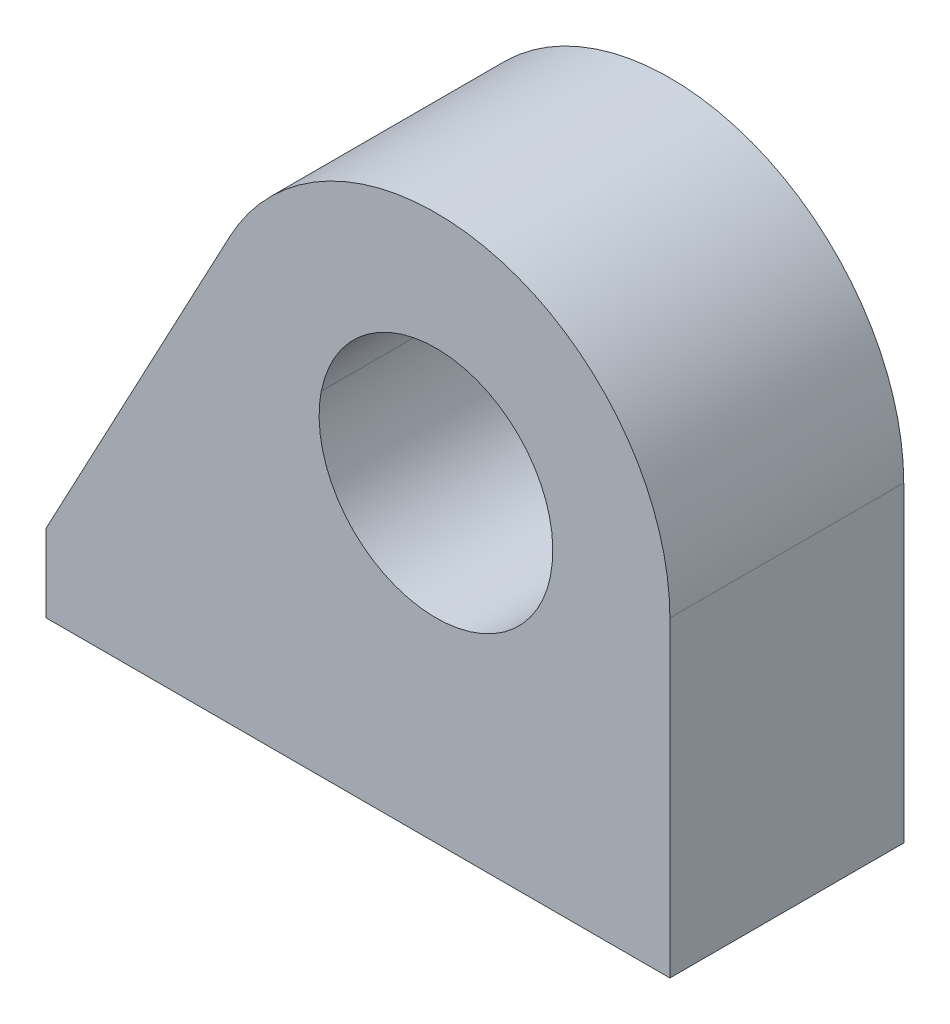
from build123d import *

# Parameters (mm, degrees)
EXTRUSION1_DEPTH      = 7.5
EXTRUSION1_DEPTH_BACK = 7.5
ESQUISSE1_R           = 7.5
EXTRUSION2_DEPTH      = 15


with BuildPart() as part:
    # Esquisse1 → Extrusion1 (new, two sides: drawn at the far end of the back side and taken through both)
    with BuildSketch(Plane.XY.offset(-EXTRUSION1_DEPTH_BACK)):
        with BuildLine():
            Line((-640, 305), (-600, 305))
            Line((-600, 305), (-600, 325))
            ThreePointArc((-600, 325), (-611.361965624, 339.552137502), (-628.235294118, 332.058823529))
            Line((-628.235294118, 332.058823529), (-640, 310))
            Line((-640, 310), (-640, 305))
        make_face()
        with Locations((-615, 325)):
            Circle(ESQUISSE1_R, mode=Mode.SUBTRACT)
    extrude(amount=EXTRUSION1_DEPTH + EXTRUSION1_DEPTH_BACK)

    # Esquisse2 → Extrusion2 (add)
    with BuildSketch(Plane.XY.offset(7.5)):
        with BuildLine():
            Line((-622.352387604, 326.429159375), (-626.153797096, 327.168078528))
            Line((-626.153797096, 327.168078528), (-620.368814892, 336.633756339))
            Line((-620.368814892, 336.633756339), (-603.653325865, 331.104974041))
            Line((-603.653325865, 331.104974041), (-603.653325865, 322.794429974))
            Line((-603.653325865, 322.794429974), (-607.647612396, 323.570840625))
            ThreePointArc((-607.647612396, 323.570840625), (-613.570840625, 332.352387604), (-622.352387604, 326.429159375))
        make_face()
    extrude(amount=-EXTRUSION2_DEPTH)


solid = part.part
